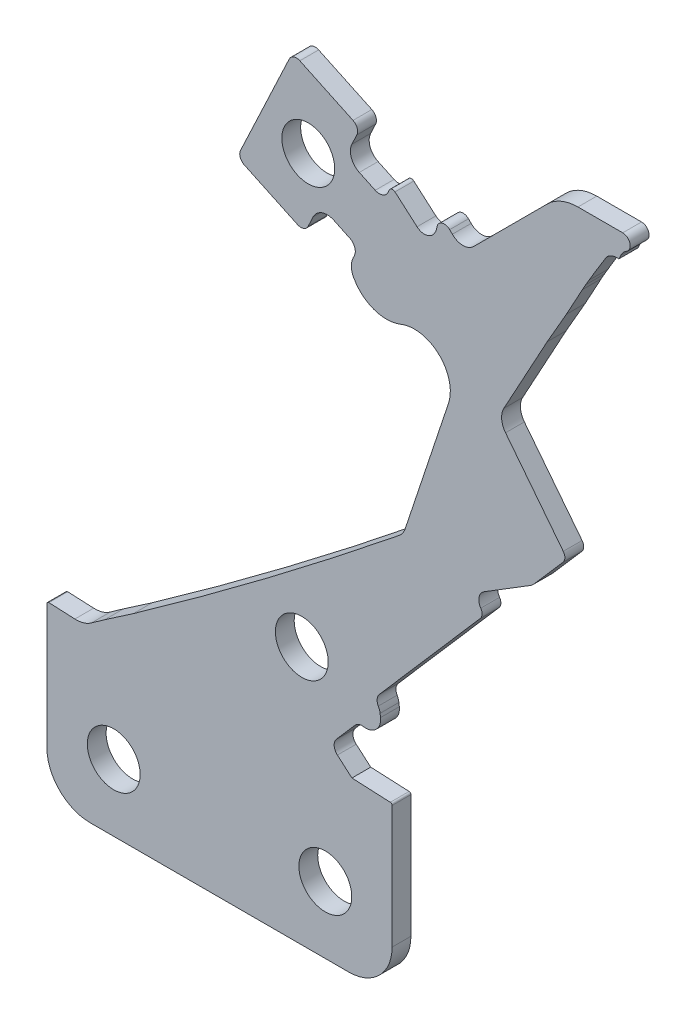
from build123d import *

# Parameters (mm, degrees)
BOSS_EXTRUDE1_DEPTH = 2.54
HOLE1_D             = 7.1374
HOLE11_D            = 7.1374


with BuildPart() as part:
    # Sketch1 → Boss-Extrude1 (new body)
    with BuildSketch(Plane.XY):
        with BuildLine():
            Line((-360.400200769, -2.933650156), (-359.724293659, -1.497228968))
            ThreePointArc((-359.724293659, -1.497228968), (-359.685383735, -0.671932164), (-360.241443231, -0.060845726))
            Line((-360.241443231, -0.060845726), (-367.423549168, 3.318689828))
            ThreePointArc((-367.423549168, 3.318689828), (-368.248845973, 3.357599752), (-368.859932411, 2.801540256))
            Line((-368.859932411, 2.801540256), (-375.437887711, -11.177768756))
            ThreePointArc((-375.437887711, -11.177768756), (-375.476797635, -12.00306556), (-374.920738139, -12.614151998))
            Line((-374.920738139, -12.614151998), (-367.738632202, -15.993687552))
            ThreePointArc((-367.738632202, -15.993687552), (-366.913335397, -16.032597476), (-366.302248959, -15.47653798))
            Line((-366.302248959, -15.47653798), (-365.626341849, -14.040116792))
            ThreePointArc((-365.626341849, -14.040116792), (-364.440115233, -12.960707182), (-362.838068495, -13.036238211))
            Line((-362.838068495, -13.036238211), (-360.683436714, -14.050098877))
            ThreePointArc((-360.683436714, -14.050098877), (-360.01289438, -14.786997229), (-360.059815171, -15.782208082))
            Line((-360.059815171, -15.782208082), (-360.228791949, -16.141313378))
            ThreePointArc((-360.228791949, -16.141313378), (-360.464914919, -17.258996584), (-360.176736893, -18.364402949))
            ThreePointArc((-360.176736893, -18.364402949), (-357.432911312, -20.753034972), (-353.795721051, -20.682403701))
            ThreePointArc((-353.795721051, -20.682403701), (-348.641613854, -21.633545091), (-347.351128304, -26.713322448))
            Line((-347.351128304, -26.713322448), (-353.205839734, -44.322451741))
            ThreePointArc((-353.205839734, -44.322451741), (-353.525178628, -44.960908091), (-354.011458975, -45.483531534))
            ThreePointArc((-354.011458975, -45.483531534), (-371.739839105, -59.315255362), (-389.903017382, -72.570857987))
            Line((-389.903017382, -72.570857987), (-393.778847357, -75.223048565))
            ThreePointArc((-393.778847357, -75.223048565), (-394.675767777, -75.858222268), (-395.57133703, -76.495299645))
            ThreePointArc((-395.57133703, -76.495299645), (-396.631998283, -77.011270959), (-397.803086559, -77.151915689))
            Line((-397.803086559, -77.151915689), (-401.308043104, -76.986738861))
            ThreePointArc((-401.308043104, -76.986738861), (-401.495326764, -77.056673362), (-401.574, -77.240457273))
            Line((-401.574, -77.240457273), (-401.574, -94.107))
            ThreePointArc((-401.574, -94.107), (-399.862917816, -98.237917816), (-395.732, -99.949))
            Line((-395.732, -99.949), (-360.807, -99.949))
            ThreePointArc((-360.807, -99.949), (-356.676082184, -98.237917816), (-354.965, -94.107))
            Line((-354.965, -94.107), (-354.965, -77.539711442))
            ThreePointArc((-354.965, -77.539711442), (-355.035216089, -77.364384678), (-355.207043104, -77.28599303))
            Line((-355.207043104, -77.28599303), (-360.390031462, -77.041736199))
            Line((-360.390031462, -77.041736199), (-362.352447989, -75.337516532))
            ThreePointArc((-362.352447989, -75.337516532), (-362.786584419, -74.4678382), (-362.478609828, -73.545901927))
            Line((-362.478609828, -73.545901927), (-359.983248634, -70.672481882))
            ThreePointArc((-359.983248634, -70.672481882), (-359.457901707, -70.311500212), (-358.823344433, -70.251218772))
            ThreePointArc((-358.823344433, -70.251218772), (-357.12685346, -69.719719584), (-356.530497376, -68.044925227))
            Line((-356.530497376, -68.044925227), (-356.587557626, -67.573556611))
            ThreePointArc((-356.587557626, -67.573556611), (-356.670891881, -67.196565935), (-356.825385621, -66.842732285))
            ThreePointArc((-356.825385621, -66.842732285), (-356.979466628, -66.093339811), (-356.675108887, -65.391416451))
            Line((-356.675108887, -65.391416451), (-343.066536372, -49.721081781))
            ThreePointArc((-343.066536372, -49.721081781), (-342.819397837, -49.114521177), (-342.993769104, -48.483183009))
            ThreePointArc((-342.993769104, -48.483183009), (-343.2244212, -47.307678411), (-342.534181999, -46.328606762))
            Line((-342.534181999, -46.328606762), (-336.353875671, -42.515448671))
            ThreePointArc((-336.353875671, -42.515448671), (-336.027479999, -42.278199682), (-335.740612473, -41.994424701))
            Line((-335.740612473, -41.994424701), (-331.884177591, -37.553722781))
            ThreePointArc((-331.884177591, -37.553722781), (-331.635623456, -36.913641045), (-331.850975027, -36.261638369))
            Line((-331.850975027, -36.261638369), (-339.646319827, -26.294096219))
            ThreePointArc((-339.646319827, -26.294096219), (-340.170346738, -24.954087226), (-339.871686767, -23.546596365))
            Line((-339.871686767, -23.546596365), (-334.018172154, -12.832487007))
            Line((-334.018172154, -12.832487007), (-331.435803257, -8.3355447))
            Line((-331.435803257, -8.3355447), (-329.267638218, -4.366996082))
            ThreePointArc((-329.267638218, -4.366996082), (-329.049038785, -3.975569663), (-328.828592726, -3.585180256))
            ThreePointArc((-328.828592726, -3.585180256), (-328.601770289, -3.197269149), (-328.37044881, -2.812024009))
            ThreePointArc((-328.37044881, -2.812024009), (-327.248775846, -0.933734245), (-326.096311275, 0.925821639))
            ThreePointArc((-326.096311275, 0.925821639), (-325.853313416, 1.220260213), (-325.544162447, 1.444241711))
            ThreePointArc((-325.544162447, 1.444241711), (-324.977879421, 1.654973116), (-324.375079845, 1.696408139))
            ThreePointArc((-324.375079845, 1.696408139), (-324.327403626, 1.707747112), (-324.295087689, 1.744588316))
            ThreePointArc((-324.295087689, 1.744588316), (-324.19198398, 1.979358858), (-324.087766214, 2.213636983))
            ThreePointArc((-324.087766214, 2.213636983), (-323.758412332, 2.72593658), (-323.292038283, 3.117625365))
            ThreePointArc((-323.292038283, 3.117625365), (-322.843406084, 4.259758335), (-323.821484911, 5.000771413))
            Line((-323.821484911, 5.000771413), (-329.866864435, 5.000771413))
            ThreePointArc((-329.866864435, 5.000771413), (-332.102501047, 4.556075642), (-333.997782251, 3.289689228))
            Line((-333.997782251, 3.289689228), (-343.958350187, -6.670878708))
            ThreePointArc((-343.958350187, -6.670878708), (-345.395191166, -7.266037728), (-346.832032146, -6.670878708))
            Line((-346.832032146, -6.670878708), (-347.19124239, -6.311668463))
            ThreePointArc((-347.19124239, -6.311668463), (-348.236961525, -6.068251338), (-348.917167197, -6.898974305))
            ThreePointArc((-348.917167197, -6.898974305), (-349.07865102, -7.469493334), (-349.397954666, -7.969107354))
            Line((-349.397954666, -7.969107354), (-349.446223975, -8.024689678))
            ThreePointArc((-349.446223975, -8.024689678), (-350.489838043, -8.545653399), (-351.596161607, -8.176083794))
            Line((-351.596161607, -8.176083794), (-354.572827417, -5.591060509))
            ThreePointArc((-354.572827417, -5.591060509), (-354.996999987, -5.481134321), (-355.340604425, -5.753057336))
            Line((-355.340604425, -5.753057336), (-355.509581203, -6.112162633))
            ThreePointArc((-355.509581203, -6.112162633), (-356.246479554, -6.782704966), (-357.241690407, -6.735784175))
            Line((-357.241690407, -6.735784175), (-359.396322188, -5.721923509))
            ThreePointArc((-359.396322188, -5.721923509), (-360.475731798, -4.535696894), (-360.400200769, -2.933650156))
        make_face()
    extrude(amount=BOSS_EXTRUDE1_DEPTH)

    # Hole1 (through all)
    with Locations(Plane(origin=(-363.502739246, -54.486359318, 0), x_dir=(-1, 0, 0), z_dir=(0, 0, -1))):
        with Locations((3.654260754, -10.601140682), (29.054260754, -36.445640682), (0.479260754, -36.445640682)):
            Hole(HOLE1_D / 2)

    # Hole11 (through all)
    with Locations(Plane(origin=(-362.634050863, 3.65532542, 0), x_dir=(-1, 0, 0), z_dir=(0, 0, -1))):
        with Locations((3.654260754, -10.601140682)):
            Hole(HOLE11_D / 2)


solid = part.part
